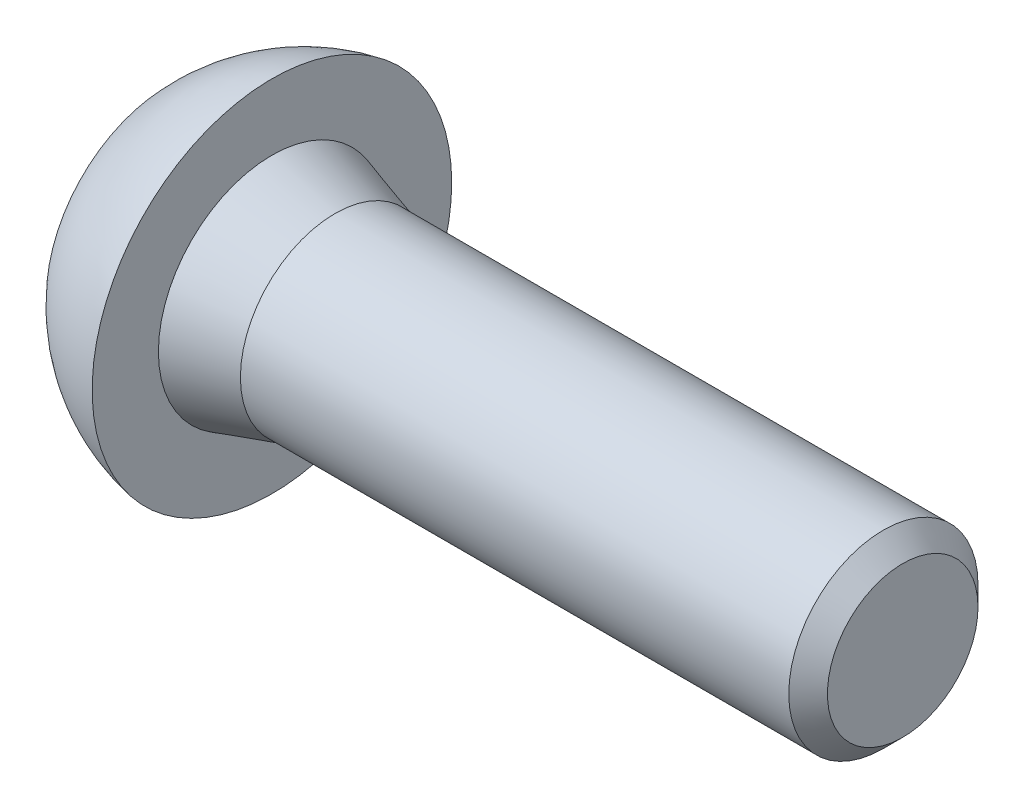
ISO-10303-21;
HEADER;
FILE_DESCRIPTION(('STEP AP214'),'2;1');
FILE_NAME('part.step','',(''),(''),'','','');
FILE_SCHEMA(('AUTOMOTIVE_DESIGN { 1 0 10303 214 1 1 1 1 }'));
ENDSEC;
DATA;
#1=APPLICATION_CONTEXT('core data for automotive mechanical design processes');
#2=APPLICATION_PROTOCOL_DEFINITION('international standard','automotive_design',2000,#1);
#3=PRODUCT_CONTEXT('',#1,'mechanical');
#4=PRODUCT('Part','Part','',(#3));
#5=PRODUCT_RELATED_PRODUCT_CATEGORY('part','',(#4));
#6=PRODUCT_DEFINITION_FORMATION('','',#4);
#7=PRODUCT_DEFINITION_CONTEXT('part definition',#1,'design');
#8=PRODUCT_DEFINITION('design','',#6,#7);
#9=PRODUCT_DEFINITION_SHAPE('','',#8);
#10=(LENGTH_UNIT() NAMED_UNIT(*) SI_UNIT(.MILLI.,.METRE.));
#11=(NAMED_UNIT(*) PLANE_ANGLE_UNIT() SI_UNIT($,.RADIAN.));
#12=(NAMED_UNIT(*) SI_UNIT($,.STERADIAN.) SOLID_ANGLE_UNIT());
#13=UNCERTAINTY_MEASURE_WITH_UNIT(LENGTH_MEASURE(1.E-05),#10,'distance_accuracy_value','');
#14=(GEOMETRIC_REPRESENTATION_CONTEXT(3) GLOBAL_UNCERTAINTY_ASSIGNED_CONTEXT((#13)) GLOBAL_UNIT_ASSIGNED_CONTEXT((#10,
#11,#12)) REPRESENTATION_CONTEXT('',''));
#15=CARTESIAN_POINT('',(0.,0.,0.));
#16=DIRECTION('',(0.,0.,1.));
#17=DIRECTION('',(1.,0.,0.));
#18=AXIS2_PLACEMENT_3D('',#15,#16,#17);
#19=CARTESIAN_POINT('',(-1.65,1.,0.));
#20=DIRECTION('',(1.,0.,0.));
#21=DIRECTION('',(0.,0.,-1.));
#22=AXIS2_PLACEMENT_3D('',#19,#20,#21);
#23=PLANE('',#22);
#24=CARTESIAN_POINT('',(-1.65,0.,0.));
#25=DIRECTION('',(1.,0.,0.));
#26=DIRECTION('',(0.,0.,-1.));
#27=AXIS2_PLACEMENT_3D('',#24,#25,#26);
#28=CIRCLE('',#27,1.925);
#29=CARTESIAN_POINT('',(-1.65,0.,-1.925));
#30=VERTEX_POINT('',#29);
#31=EDGE_CURVE('E134',#30,#30,#28,.T.);
#32=ORIENTED_EDGE('',*,*,#31,.F.);
#33=EDGE_LOOP('',(#32));
#34=FACE_BOUND('',#33,.T.);
#35=DIRECTION('',(0.,-0.5,0.866025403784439));
#36=VECTOR('',#35,1.);
#37=CARTESIAN_POINT('',(-1.65,-0.616025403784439,-0.933012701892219));
#38=LINE('',#37,#36);
#39=CARTESIAN_POINT('',(-1.65,-0.577350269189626,-1.));
#40=VERTEX_POINT('',#39);
#41=CARTESIAN_POINT('',(-1.65,-1.15470053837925,0.));
#42=VERTEX_POINT('',#41);
#43=EDGE_CURVE('E10',#40,#42,#38,.T.);
#44=ORIENTED_EDGE('',*,*,#43,.F.);
#45=DIRECTION('',(0.,-1.,0.));
#46=VECTOR('',#45,1.);
#47=CARTESIAN_POINT('',(-1.65,1.,-1.));
#48=LINE('',#47,#46);
#49=CARTESIAN_POINT('',(-1.65,0.577350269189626,-1.));
#50=VERTEX_POINT('',#49);
#51=EDGE_CURVE('E147',#50,#40,#48,.T.);
#52=ORIENTED_EDGE('',*,*,#51,.F.);
#53=DIRECTION('',(0.,-0.5,-0.866025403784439));
#54=VECTOR('',#53,1.);
#55=CARTESIAN_POINT('',(-1.65,1.11602540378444,-0.0669872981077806));
#56=LINE('',#55,#54);
#57=CARTESIAN_POINT('',(-1.65,1.15470053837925,0.));
#58=VERTEX_POINT('',#57);
#59=EDGE_CURVE('E143',#58,#50,#56,.T.);
#60=ORIENTED_EDGE('',*,*,#59,.F.);
#61=DIRECTION('',(0.,0.5,-0.866025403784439));
#62=VECTOR('',#61,1.);
#63=CARTESIAN_POINT('',(-1.65,1.11602540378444,0.0669872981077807));
#64=LINE('',#63,#62);
#65=CARTESIAN_POINT('',(-1.65,0.577350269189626,1.));
#66=VERTEX_POINT('',#65);
#67=EDGE_CURVE('E140',#66,#58,#64,.T.);
#68=ORIENTED_EDGE('',*,*,#67,.F.);
#69=DIRECTION('',(0.,1.,0.));
#70=VECTOR('',#69,1.);
#71=CARTESIAN_POINT('',(-1.65,1.,1.));
#72=LINE('',#71,#70);
#73=CARTESIAN_POINT('',(-1.65,-0.577350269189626,1.));
#74=VERTEX_POINT('',#73);
#75=EDGE_CURVE('E145',#74,#66,#72,.T.);
#76=ORIENTED_EDGE('',*,*,#75,.F.);
#77=DIRECTION('',(0.,0.5,0.866025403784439));
#78=VECTOR('',#77,1.);
#79=CARTESIAN_POINT('',(-1.65,-0.616025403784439,0.933012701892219));
#80=LINE('',#79,#78);
#81=EDGE_CURVE('E24',#42,#74,#80,.T.);
#82=ORIENTED_EDGE('',*,*,#81,.F.);
#83=EDGE_LOOP('',(#44,#52,#60,#68,#76,#82));
#84=FACE_BOUND('',#83,.T.);
#85=ADVANCED_FACE('F16',(#34,#84),#23,.F.);
#86=CARTESIAN_POINT('',(0.489686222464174,0.,0.));
#87=DIRECTION('',(1.,0.,0.));
#88=DIRECTION('',(0.,0.,-1.));
#89=AXIS2_PLACEMENT_3D('',#86,#87,#88);
#90=DEGENERATE_TOROIDAL_SURFACE('',#89,0.0423840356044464,2.85,.T.);
#91=ORIENTED_EDGE('',*,*,#31,.T.);
#92=EDGE_LOOP('',(#91));
#93=FACE_BOUND('',#92,.T.);
#94=CARTESIAN_POINT('',(0.,0.,0.));
#95=DIRECTION('',(1.,0.,0.));
#96=DIRECTION('',(0.,0.,-1.));
#97=AXIS2_PLACEMENT_3D('',#94,#95,#96);
#98=CIRCLE('',#97,2.85);
#99=CARTESIAN_POINT('',(0.,0.,-2.85));
#100=VERTEX_POINT('',#99);
#101=EDGE_CURVE('E131',#100,#100,#98,.T.);
#102=ORIENTED_EDGE('',*,*,#101,.F.);
#103=EDGE_LOOP('',(#102));
#104=FACE_BOUND('',#103,.T.);
#105=ADVANCED_FACE('F219',(#93,#104),#90,.T.);
#106=CARTESIAN_POINT('',(0.,2.85,0.));
#107=DIRECTION('',(-1.,0.,0.));
#108=DIRECTION('',(0.,0.,1.));
#109=AXIS2_PLACEMENT_3D('',#106,#107,#108);
#110=PLANE('',#109);
#111=CARTESIAN_POINT('',(0.,0.,0.));
#112=DIRECTION('',(1.,0.,0.));
#113=DIRECTION('',(0.,0.,-1.));
#114=AXIS2_PLACEMENT_3D('',#111,#112,#113);
#115=CIRCLE('',#114,1.8);
#116=CARTESIAN_POINT('',(0.,0.,-1.8));
#117=VERTEX_POINT('',#116);
#118=EDGE_CURVE('E128',#117,#117,#115,.T.);
#119=ORIENTED_EDGE('',*,*,#118,.F.);
#120=EDGE_LOOP('',(#119));
#121=FACE_BOUND('',#120,.T.);
#122=ORIENTED_EDGE('',*,*,#101,.T.);
#123=EDGE_LOOP('',(#122));
#124=FACE_BOUND('',#123,.T.);
#125=ADVANCED_FACE('F224',(#121,#124),#110,.F.);
#126=CARTESIAN_POINT('',(0.,0.,0.));
#127=DIRECTION('',(-1.,0.,0.));
#128=DIRECTION('',(0.,0.,1.));
#129=AXIS2_PLACEMENT_3D('',#126,#127,#128);
#130=CONICAL_SURFACE('',#129,1.8,0.291456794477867);
#131=CARTESIAN_POINT('',(0.999999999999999,0.,0.));
#132=DIRECTION('',(1.,0.,0.));
#133=DIRECTION('',(0.,0.,-1.));
#134=AXIS2_PLACEMENT_3D('',#131,#132,#133);
#135=CIRCLE('',#134,1.5);
#136=CARTESIAN_POINT('',(0.999999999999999,0.,-1.5));
#137=VERTEX_POINT('',#136);
#138=EDGE_CURVE('E125',#137,#137,#135,.T.);
#139=ORIENTED_EDGE('',*,*,#138,.F.);
#140=EDGE_LOOP('',(#139));
#141=FACE_BOUND('',#140,.T.);
#142=ORIENTED_EDGE('',*,*,#118,.T.);
#143=EDGE_LOOP('',(#142));
#144=FACE_BOUND('',#143,.T.);
#145=ADVANCED_FACE('F231',(#141,#144),#130,.T.);
#146=CARTESIAN_POINT('',(10.,0.,0.));
#147=DIRECTION('',(1.,0.,0.));
#148=DIRECTION('',(0.,0.,-1.));
#149=AXIS2_PLACEMENT_3D('',#146,#147,#148);
#150=CYLINDRICAL_SURFACE('',#149,1.5);
#151=CARTESIAN_POINT('',(9.6935,0.,0.));
#152=DIRECTION('',(1.,0.,0.));
#153=DIRECTION('',(0.,0.,-1.));
#154=AXIS2_PLACEMENT_3D('',#151,#152,#153);
#155=CIRCLE('',#154,1.5);
#156=CARTESIAN_POINT('',(9.6935,0.,-1.5));
#157=VERTEX_POINT('',#156);
#158=EDGE_CURVE('E117',#157,#157,#155,.T.);
#159=ORIENTED_EDGE('',*,*,#158,.F.);
#160=EDGE_LOOP('',(#159));
#161=FACE_BOUND('',#160,.T.);
#162=ORIENTED_EDGE('',*,*,#138,.T.);
#163=EDGE_LOOP('',(#162));
#164=FACE_BOUND('',#163,.T.);
#165=ADVANCED_FACE('F235',(#161,#164),#150,.T.);
#166=CARTESIAN_POINT('',(9.6935,0.,0.));
#167=DIRECTION('',(-1.,0.,0.));
#168=DIRECTION('',(0.,0.,1.));
#169=AXIS2_PLACEMENT_3D('',#166,#167,#168);
#170=CONICAL_SURFACE('',#169,1.5,0.785398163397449);
#171=CARTESIAN_POINT('',(10.,0.,0.));
#172=DIRECTION('',(1.,0.,0.));
#173=DIRECTION('',(0.,0.,-1.));
#174=AXIS2_PLACEMENT_3D('',#171,#172,#173);
#175=CIRCLE('',#174,1.1935);
#176=CARTESIAN_POINT('',(10.,0.,-1.1935));
#177=VERTEX_POINT('',#176);
#178=EDGE_CURVE('E113',#177,#177,#175,.T.);
#179=ORIENTED_EDGE('',*,*,#178,.F.);
#180=EDGE_LOOP('',(#179));
#181=FACE_BOUND('',#180,.T.);
#182=ORIENTED_EDGE('',*,*,#158,.T.);
#183=EDGE_LOOP('',(#182));
#184=FACE_BOUND('',#183,.T.);
#185=ADVANCED_FACE('F239',(#181,#184),#170,.T.);
#186=CARTESIAN_POINT('',(10.,1.1935,0.));
#187=DIRECTION('',(-1.,0.,0.));
#188=DIRECTION('',(0.,0.,1.));
#189=AXIS2_PLACEMENT_3D('',#186,#187,#188);
#190=PLANE('',#189);
#191=ORIENTED_EDGE('',*,*,#178,.T.);
#192=EDGE_LOOP('',(#191));
#193=FACE_BOUND('',#192,.T.);
#194=ADVANCED_FACE('F243',(#193),#190,.F.);
#195=CARTESIAN_POINT('',(-0.61,0.,0.));
#196=DIRECTION('',(1.,0.,0.));
#197=DIRECTION('',(0.,0.,-1.));
#198=AXIS2_PLACEMENT_3D('',#195,#196,#197);
#199=PLANE('',#198);
#200=DIRECTION('',(0.,1.,0.));
#201=VECTOR('',#200,1.);
#202=CARTESIAN_POINT('',(-0.61,-0.577350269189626,-1.));
#203=LINE('',#202,#201);
#204=CARTESIAN_POINT('',(-0.61,-0.577350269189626,-1.));
#205=VERTEX_POINT('',#204);
#206=CARTESIAN_POINT('',(-0.609999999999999,0.,-1.));
#207=VERTEX_POINT('',#206);
#208=EDGE_CURVE('E31',#205,#207,#203,.T.);
#209=ORIENTED_EDGE('',*,*,#208,.F.);
#210=DIRECTION('',(0.,0.5,-0.866025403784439));
#211=VECTOR('',#210,1.);
#212=CARTESIAN_POINT('',(-0.61,-1.15470053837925,0.));
#213=LINE('',#212,#211);
#214=CARTESIAN_POINT('',(-0.609999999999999,-0.866025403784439,-0.5));
#215=VERTEX_POINT('',#214);
#216=EDGE_CURVE('E107',#215,#205,#213,.T.);
#217=ORIENTED_EDGE('',*,*,#216,.F.);
#218=CARTESIAN_POINT('',(-0.609999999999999,0.,0.));
#219=DIRECTION('',(1.,0.,0.));
#220=DIRECTION('',(0.,0.,-1.));
#221=AXIS2_PLACEMENT_3D('',#218,#219,#220);
#222=CIRCLE('',#221,1.);
#223=EDGE_CURVE('E192',#215,#207,#222,.T.);
#224=ORIENTED_EDGE('',*,*,#223,.T.);
#225=EDGE_LOOP('',(#209,#217,#224));
#226=FACE_BOUND('',#225,.T.);
#227=ADVANCED_FACE('F195',(#226),#199,.F.);
#228=CARTESIAN_POINT('',(-0.61,-1.15470053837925,0.));
#229=VERTEX_POINT('',#228);
#230=EDGE_CURVE('E185',#229,#215,#213,.T.);
#231=ORIENTED_EDGE('',*,*,#230,.F.);
#232=DIRECTION('',(0.,-0.5,-0.866025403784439));
#233=VECTOR('',#232,1.);
#234=CARTESIAN_POINT('',(-0.61,-0.577350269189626,1.));
#235=LINE('',#234,#233);
#236=CARTESIAN_POINT('',(-0.609999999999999,-0.866025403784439,0.5));
#237=VERTEX_POINT('',#236);
#238=EDGE_CURVE('E108',#237,#229,#235,.T.);
#239=ORIENTED_EDGE('',*,*,#238,.F.);
#240=EDGE_CURVE('E190',#237,#215,#222,.T.);
#241=ORIENTED_EDGE('',*,*,#240,.T.);
#242=EDGE_LOOP('',(#231,#239,#241));
#243=FACE_BOUND('',#242,.T.);
#244=ADVANCED_FACE('F189',(#243),#199,.F.);
#245=CARTESIAN_POINT('',(-0.61,-0.577350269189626,1.));
#246=VERTEX_POINT('',#245);
#247=EDGE_CURVE('E101',#246,#237,#235,.T.);
#248=ORIENTED_EDGE('',*,*,#247,.F.);
#249=DIRECTION('',(0.,-1.,0.));
#250=VECTOR('',#249,1.);
#251=CARTESIAN_POINT('',(-0.61,0.577350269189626,1.));
#252=LINE('',#251,#250);
#253=CARTESIAN_POINT('',(-0.609999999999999,0.,1.));
#254=VERTEX_POINT('',#253);
#255=EDGE_CURVE('E88',#254,#246,#252,.T.);
#256=ORIENTED_EDGE('',*,*,#255,.F.);
#257=EDGE_CURVE('E103',#254,#237,#222,.T.);
#258=ORIENTED_EDGE('',*,*,#257,.T.);
#259=EDGE_LOOP('',(#248,#256,#258));
#260=FACE_BOUND('',#259,.T.);
#261=ADVANCED_FACE('F102',(#260),#199,.F.);
#262=CARTESIAN_POINT('',(-0.61,0.577350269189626,1.));
#263=VERTEX_POINT('',#262);
#264=EDGE_CURVE('E96',#263,#254,#252,.T.);
#265=ORIENTED_EDGE('',*,*,#264,.F.);
#266=DIRECTION('',(0.,-0.5,0.866025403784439));
#267=VECTOR('',#266,1.);
#268=CARTESIAN_POINT('',(-0.61,1.15470053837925,0.));
#269=LINE('',#268,#267);
#270=CARTESIAN_POINT('',(-0.609999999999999,0.866025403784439,0.5));
#271=VERTEX_POINT('',#270);
#272=EDGE_CURVE('E171',#271,#263,#269,.T.);
#273=ORIENTED_EDGE('',*,*,#272,.F.);
#274=EDGE_CURVE('E141',#271,#254,#222,.T.);
#275=ORIENTED_EDGE('',*,*,#274,.T.);
#276=EDGE_LOOP('',(#265,#273,#275));
#277=FACE_BOUND('',#276,.T.);
#278=ADVANCED_FACE('F209',(#277),#199,.F.);
#279=CARTESIAN_POINT('',(-0.61,1.15470053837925,0.));
#280=VERTEX_POINT('',#279);
#281=EDGE_CURVE('E173',#280,#271,#269,.T.);
#282=ORIENTED_EDGE('',*,*,#281,.F.);
#283=DIRECTION('',(0.,0.5,0.866025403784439));
#284=VECTOR('',#283,1.);
#285=CARTESIAN_POINT('',(-0.61,0.577350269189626,-1.));
#286=LINE('',#285,#284);
#287=CARTESIAN_POINT('',(-0.609999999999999,0.866025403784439,-0.5));
#288=VERTEX_POINT('',#287);
#289=EDGE_CURVE('E182',#288,#280,#286,.T.);
#290=ORIENTED_EDGE('',*,*,#289,.F.);
#291=EDGE_CURVE('E138',#288,#271,#222,.T.);
#292=ORIENTED_EDGE('',*,*,#291,.T.);
#293=EDGE_LOOP('',(#282,#290,#292));
#294=FACE_BOUND('',#293,.T.);
#295=ADVANCED_FACE('F205',(#294),#199,.F.);
#296=CARTESIAN_POINT('',(-0.61,0.577350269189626,-1.));
#297=VERTEX_POINT('',#296);
#298=EDGE_CURVE('E179',#297,#288,#286,.T.);
#299=ORIENTED_EDGE('',*,*,#298,.F.);
#300=EDGE_CURVE('E184',#207,#297,#203,.T.);
#301=ORIENTED_EDGE('',*,*,#300,.F.);
#302=EDGE_CURVE('E137',#207,#288,#222,.T.);
#303=ORIENTED_EDGE('',*,*,#302,.T.);
#304=EDGE_LOOP('',(#299,#301,#303));
#305=FACE_BOUND('',#304,.T.);
#306=ADVANCED_FACE('F202',(#305),#199,.F.);
#307=CARTESIAN_POINT('',(-0.61,0.577350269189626,1.));
#308=DIRECTION('',(0.,0.,-1.));
#309=DIRECTION('',(-1.,0.,0.));
#310=AXIS2_PLACEMENT_3D('',#307,#308,#309);
#311=PLANE('',#310);
#312=ORIENTED_EDGE('',*,*,#264,.T.);
#313=ORIENTED_EDGE('',*,*,#255,.T.);
#314=DIRECTION('',(-1.,0.,0.));
#315=VECTOR('',#314,1.);
#316=CARTESIAN_POINT('',(-0.61,-0.577350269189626,1.));
#317=LINE('',#316,#315);
#318=EDGE_CURVE('E92',#246,#74,#317,.T.);
#319=ORIENTED_EDGE('',*,*,#318,.T.);
#320=ORIENTED_EDGE('',*,*,#75,.T.);
#321=DIRECTION('',(-1.,0.,0.));
#322=VECTOR('',#321,1.);
#323=CARTESIAN_POINT('',(-0.61,0.577350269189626,1.));
#324=LINE('',#323,#322);
#325=EDGE_CURVE('E164',#263,#66,#324,.T.);
#326=ORIENTED_EDGE('',*,*,#325,.F.);
#327=EDGE_LOOP('',(#312,#313,#319,#320,#326));
#328=FACE_BOUND('',#327,.T.);
#329=ADVANCED_FACE('F90',(#328),#311,.T.);
#330=CARTESIAN_POINT('',(-0.61,-0.577350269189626,1.));
#331=DIRECTION('',(0.,0.866025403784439,-0.5));
#332=DIRECTION('',(0.,0.5,0.866025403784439));
#333=AXIS2_PLACEMENT_3D('',#330,#331,#332);
#334=PLANE('',#333);
#335=ORIENTED_EDGE('',*,*,#247,.T.);
#336=ORIENTED_EDGE('',*,*,#238,.T.);
#337=DIRECTION('',(-1.,0.,0.));
#338=VECTOR('',#337,1.);
#339=CARTESIAN_POINT('',(-0.61,-1.15470053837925,0.));
#340=LINE('',#339,#338);
#341=EDGE_CURVE('E114',#229,#42,#340,.T.);
#342=ORIENTED_EDGE('',*,*,#341,.T.);
#343=ORIENTED_EDGE('',*,*,#81,.T.);
#344=ORIENTED_EDGE('',*,*,#318,.F.);
#345=EDGE_LOOP('',(#335,#336,#342,#343,#344));
#346=FACE_BOUND('',#345,.T.);
#347=ADVANCED_FACE('F110',(#346),#334,.T.);
#348=CARTESIAN_POINT('',(-0.61,-1.15470053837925,0.));
#349=DIRECTION('',(0.,0.866025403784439,0.5));
#350=DIRECTION('',(0.,-0.5,0.866025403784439));
#351=AXIS2_PLACEMENT_3D('',#348,#349,#350);
#352=PLANE('',#351);
#353=ORIENTED_EDGE('',*,*,#230,.T.);
#354=ORIENTED_EDGE('',*,*,#216,.T.);
#355=DIRECTION('',(-1.,0.,0.));
#356=VECTOR('',#355,1.);
#357=CARTESIAN_POINT('',(-0.61,-0.577350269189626,-1.));
#358=LINE('',#357,#356);
#359=EDGE_CURVE('E119',#205,#40,#358,.T.);
#360=ORIENTED_EDGE('',*,*,#359,.T.);
#361=ORIENTED_EDGE('',*,*,#43,.T.);
#362=ORIENTED_EDGE('',*,*,#341,.F.);
#363=EDGE_LOOP('',(#353,#354,#360,#361,#362));
#364=FACE_BOUND('',#363,.T.);
#365=ADVANCED_FACE('F159',(#364),#352,.T.);
#366=CARTESIAN_POINT('',(-0.61,-0.577350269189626,-1.));
#367=DIRECTION('',(0.,0.,1.));
#368=DIRECTION('',(1.,0.,0.));
#369=AXIS2_PLACEMENT_3D('',#366,#367,#368);
#370=PLANE('',#369);
#371=ORIENTED_EDGE('',*,*,#208,.T.);
#372=ORIENTED_EDGE('',*,*,#300,.T.);
#373=DIRECTION('',(-1.,0.,0.));
#374=VECTOR('',#373,1.);
#375=CARTESIAN_POINT('',(-0.61,0.577350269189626,-1.));
#376=LINE('',#375,#374);
#377=EDGE_CURVE('E153',#297,#50,#376,.T.);
#378=ORIENTED_EDGE('',*,*,#377,.T.);
#379=ORIENTED_EDGE('',*,*,#51,.T.);
#380=ORIENTED_EDGE('',*,*,#359,.F.);
#381=EDGE_LOOP('',(#371,#372,#378,#379,#380));
#382=FACE_BOUND('',#381,.T.);
#383=ADVANCED_FACE('F151',(#382),#370,.T.);
#384=CARTESIAN_POINT('',(-0.61,0.577350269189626,-1.));
#385=DIRECTION('',(0.,-0.866025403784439,0.5));
#386=DIRECTION('',(0.,-0.5,-0.866025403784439));
#387=AXIS2_PLACEMENT_3D('',#384,#385,#386);
#388=PLANE('',#387);
#389=ORIENTED_EDGE('',*,*,#298,.T.);
#390=ORIENTED_EDGE('',*,*,#289,.T.);
#391=DIRECTION('',(-1.,0.,0.));
#392=VECTOR('',#391,1.);
#393=CARTESIAN_POINT('',(-0.61,1.15470053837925,0.));
#394=LINE('',#393,#392);
#395=EDGE_CURVE('E172',#280,#58,#394,.T.);
#396=ORIENTED_EDGE('',*,*,#395,.T.);
#397=ORIENTED_EDGE('',*,*,#59,.T.);
#398=ORIENTED_EDGE('',*,*,#377,.F.);
#399=EDGE_LOOP('',(#389,#390,#396,#397,#398));
#400=FACE_BOUND('',#399,.T.);
#401=ADVANCED_FACE('F207',(#400),#388,.T.);
#402=CARTESIAN_POINT('',(-0.61,1.15470053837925,0.));
#403=DIRECTION('',(0.,-0.866025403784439,-0.5));
#404=DIRECTION('',(0.,0.5,-0.866025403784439));
#405=AXIS2_PLACEMENT_3D('',#402,#403,#404);
#406=PLANE('',#405);
#407=ORIENTED_EDGE('',*,*,#281,.T.);
#408=ORIENTED_EDGE('',*,*,#272,.T.);
#409=ORIENTED_EDGE('',*,*,#325,.T.);
#410=ORIENTED_EDGE('',*,*,#67,.T.);
#411=ORIENTED_EDGE('',*,*,#395,.F.);
#412=EDGE_LOOP('',(#407,#408,#409,#410,#411));
#413=FACE_BOUND('',#412,.T.);
#414=ADVANCED_FACE('F167',(#413),#406,.T.);
#415=CARTESIAN_POINT('',(-0.0326497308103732,0.,0.));
#416=DIRECTION('',(-1.,0.,0.));
#417=DIRECTION('',(0.,0.,1.));
#418=AXIS2_PLACEMENT_3D('',#415,#416,#417);
#419=CONICAL_SURFACE('',#418,0.,1.0471975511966);
#420=ORIENTED_EDGE('',*,*,#291,.F.);
#421=ORIENTED_EDGE('',*,*,#302,.F.);
#422=ORIENTED_EDGE('',*,*,#223,.F.);
#423=ORIENTED_EDGE('',*,*,#240,.F.);
#424=ORIENTED_EDGE('',*,*,#257,.F.);
#425=ORIENTED_EDGE('',*,*,#274,.F.);
#426=EDGE_LOOP('',(#420,#421,#422,#423,#424,#425));
#427=FACE_BOUND('',#426,.T.);
#428=CARTESIAN_POINT('',(-0.0326497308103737,0.,0.));
#429=VERTEX_POINT('',#428);
#430=VERTEX_LOOP('',#429);
#431=FACE_BOUND('',#430,.T.);
#432=ADVANCED_FACE('F18',(#427,#431),#419,.F.);
#433=CLOSED_SHELL('',(#85,#105,#125,#145,#165,#185,#194,#227,#244,#261,#278,#295,#306,#329,#347,
#365,#383,#401,#414,#432));
#434=MANIFOLD_SOLID_BREP('B1',#433);
#435=ADVANCED_BREP_SHAPE_REPRESENTATION('',(#18,#434),#14);
#436=SHAPE_DEFINITION_REPRESENTATION(#9,#435);
ENDSEC;
END-ISO-10303-21;
